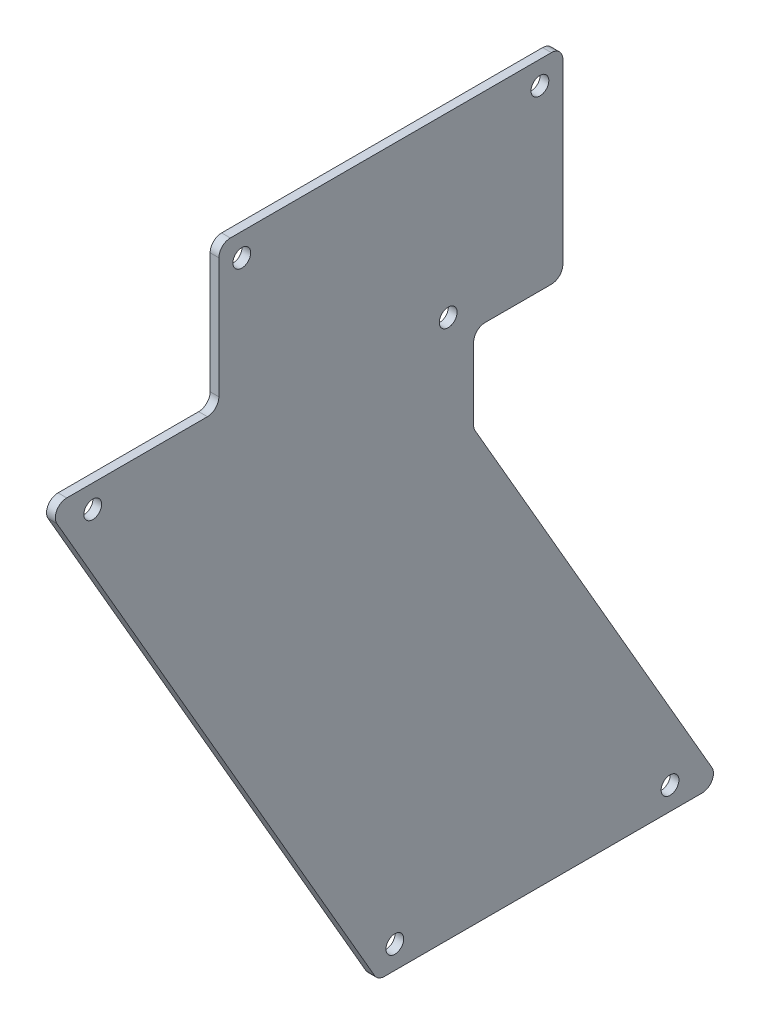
from build123d import *

# Parameters (mm, degrees)
BOSS_EXTRUDE1_DEPTH        = 1.524
F_3_1_3_1_DIAMETER_HOLE1_D = 3.1
FILLET1_R                  = 2


with BuildPart() as part:
    # Sketch1 → Boss-Extrude1 (new body)
    with BuildSketch(Plane(origin=(0, 0, 0), x_dir=(0, 0, -1), z_dir=(1, 0, 0))):
        Polygon((0, 0), (40, 0), (-3.301270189, 75), (-3.301270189, 90), (12.264973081, 90), (12.264973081, 125), (-47.735026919, 125), (-47.735026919, 100), (-77.735026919, 100), (-20, 0), align=None)
    extrude(amount=BOSS_EXTRUDE1_DEPTH)

    # 3.1 _3.1_ Diameter Hole1 (through all)
    with Locations(Plane(origin=(1.524, 0, 0), x_dir=(0, 0, -1), z_dir=(1, 0, 0))):
        with Locations((-43.735026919, 121), (8.264973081, 121), (-69.735026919, 96), (-17.04, 4), (30.96, 4), (-7.735026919, 94)):
            Hole(F_3_1_3_1_DIAMETER_HOLE1_D / 2)

    # Fillet1
    fillet1_edges = [part.edges().sort_by_distance(p)[0] for p in [
        (0.762, 0, 20),
        (0.762, 100, 77.735026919),
        (0.762, 100, 47.735026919),
        (0.762, 125, 47.735026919),
        (0.762, 125, -12.264973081),
        (0.762, 90, -12.264973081),
        (0.762, 90, 3.301270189),
        (0.762, 75, 3.301270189),
        (0.762, 0, -40),
    ]]
    fillet(fillet1_edges, radius=FILLET1_R)


solid = part.part
